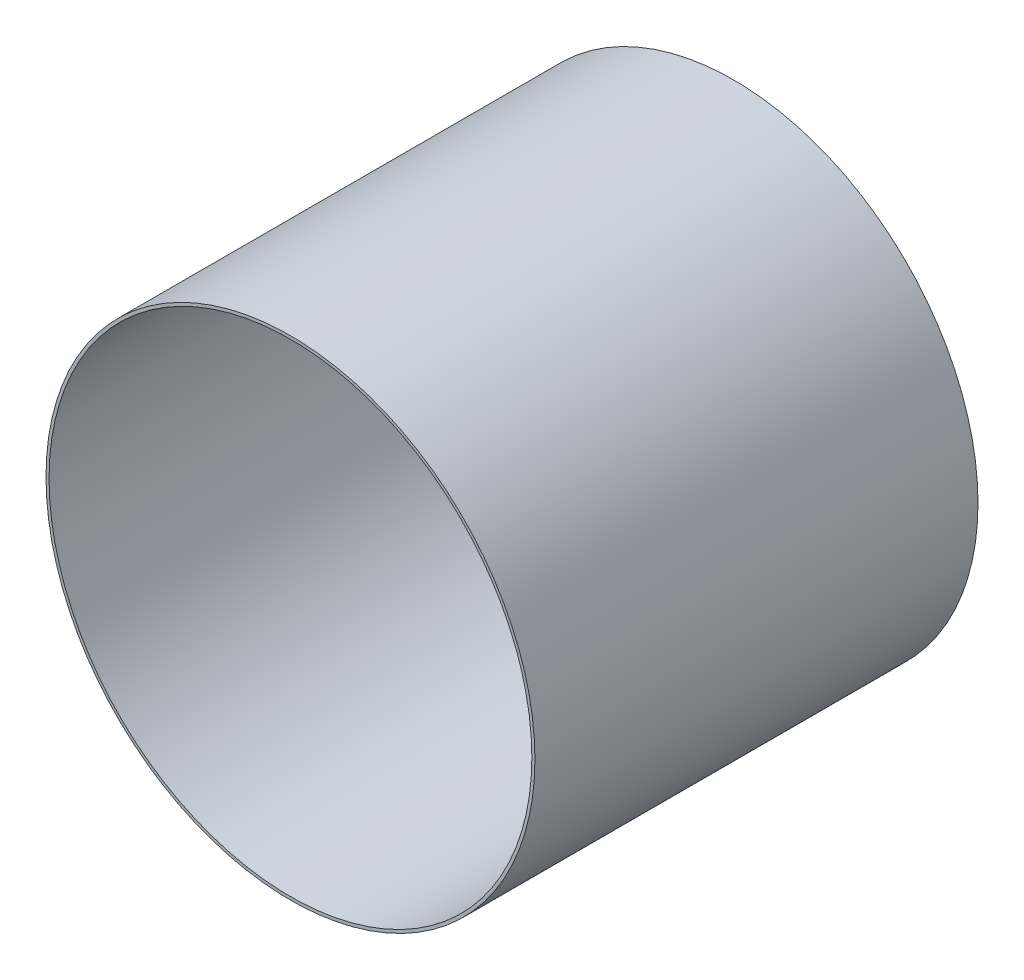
from build123d import *

# Parameters (mm, degrees)
SKETCH1_R           = 160
SKETCH1_R_2         = 158
BOSS_EXTRUDE1_DEPTH = 290


with BuildPart() as part:
    # Sketch1 → Boss-Extrude1 (new body)
    with BuildSketch(Plane.XY):
        Circle(SKETCH1_R)
        Circle(SKETCH1_R_2, mode=Mode.SUBTRACT)
    extrude(amount=BOSS_EXTRUDE1_DEPTH)


solid = part.part
